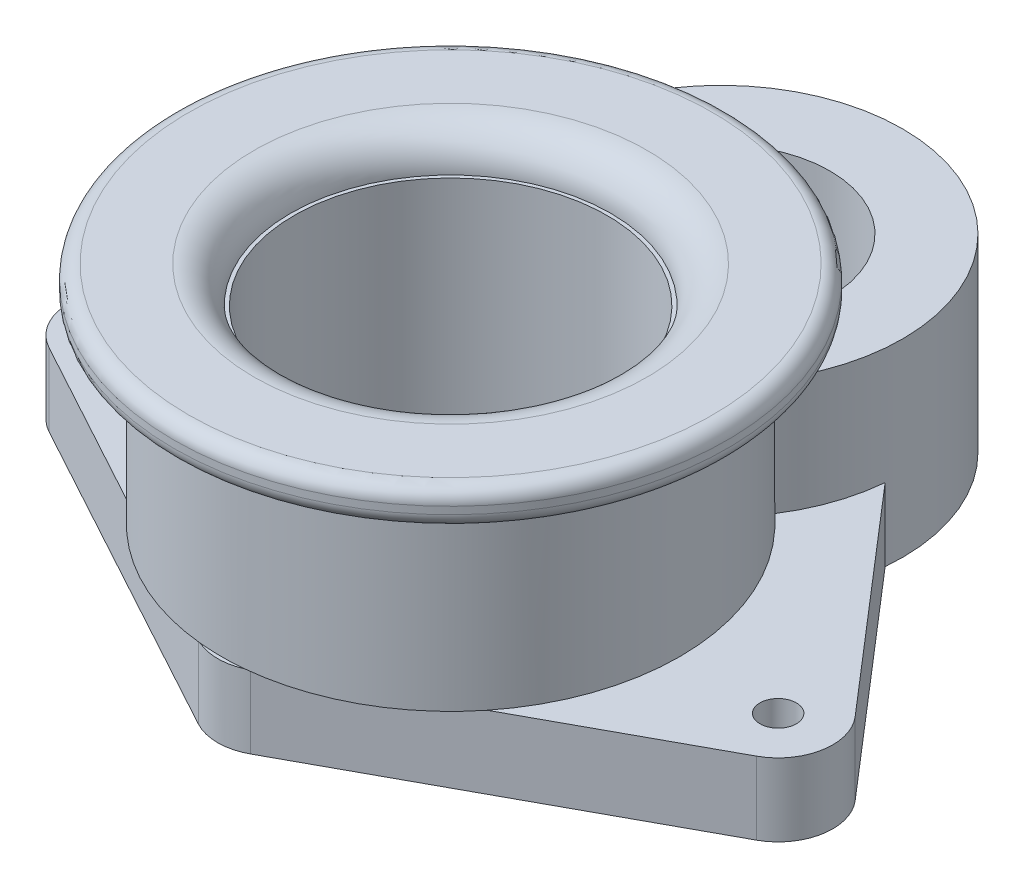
ISO-10303-21;
HEADER;
FILE_DESCRIPTION(('STEP AP214'),'2;1');
FILE_NAME('part.step','',(''),(''),'','','');
FILE_SCHEMA(('AUTOMOTIVE_DESIGN { 1 0 10303 214 1 1 1 1 }'));
ENDSEC;
DATA;
#1=APPLICATION_CONTEXT('core data for automotive mechanical design processes');
#2=APPLICATION_PROTOCOL_DEFINITION('international standard','automotive_design',2000,#1);
#3=PRODUCT_CONTEXT('',#1,'mechanical');
#4=PRODUCT('Part','Part','',(#3));
#5=PRODUCT_RELATED_PRODUCT_CATEGORY('part','',(#4));
#6=PRODUCT_DEFINITION_FORMATION('','',#4);
#7=PRODUCT_DEFINITION_CONTEXT('part definition',#1,'design');
#8=PRODUCT_DEFINITION('design','',#6,#7);
#9=PRODUCT_DEFINITION_SHAPE('','',#8);
#10=(LENGTH_UNIT() NAMED_UNIT(*) SI_UNIT(.MILLI.,.METRE.));
#11=(NAMED_UNIT(*) PLANE_ANGLE_UNIT() SI_UNIT($,.RADIAN.));
#12=(NAMED_UNIT(*) SI_UNIT($,.STERADIAN.) SOLID_ANGLE_UNIT());
#13=UNCERTAINTY_MEASURE_WITH_UNIT(LENGTH_MEASURE(1.E-05),#10,'distance_accuracy_value','');
#14=(GEOMETRIC_REPRESENTATION_CONTEXT(3) GLOBAL_UNCERTAINTY_ASSIGNED_CONTEXT((#13)) GLOBAL_UNIT_ASSIGNED_CONTEXT((#10,
#11,#12)) REPRESENTATION_CONTEXT('',''));
#15=CARTESIAN_POINT('',(0.,0.,0.));
#16=DIRECTION('',(0.,0.,1.));
#17=DIRECTION('',(1.,0.,0.));
#18=AXIS2_PLACEMENT_3D('',#15,#16,#17);
#19=CARTESIAN_POINT('',(0.,36.,0.));
#20=DIRECTION('',(0.,1.,0.));
#21=DIRECTION('',(0.,0.,1.));
#22=AXIS2_PLACEMENT_3D('',#19,#20,#21);
#23=PLANE('',#22);
#24=CARTESIAN_POINT('',(0.,36.,0.));
#25=DIRECTION('',(0.,1.,0.));
#26=DIRECTION('',(0.,0.,1.));
#27=AXIS2_PLACEMENT_3D('',#24,#25,#26);
#28=CIRCLE('',#27,21.5);
#29=CARTESIAN_POINT('',(0.,36.,21.5));
#30=VERTEX_POINT('',#29);
#31=EDGE_CURVE('E366',#30,#30,#28,.T.);
#32=ORIENTED_EDGE('',*,*,#31,.F.);
#33=EDGE_LOOP('',(#32));
#34=FACE_BOUND('',#33,.T.);
#35=CARTESIAN_POINT('',(0.,36.,0.));
#36=DIRECTION('',(0.,1.,0.));
#37=DIRECTION('',(0.,0.,1.));
#38=AXIS2_PLACEMENT_3D('',#35,#36,#37);
#39=CIRCLE('',#38,22.);
#40=CARTESIAN_POINT('',(0.,36.,22.));
#41=VERTEX_POINT('',#40);
#42=EDGE_CURVE('E416',#41,#41,#39,.T.);
#43=ORIENTED_EDGE('',*,*,#42,.T.);
#44=EDGE_LOOP('',(#43));
#45=FACE_BOUND('',#44,.T.);
#46=ADVANCED_FACE('F32',(#34,#45),#23,.T.);
#47=CARTESIAN_POINT('',(0.,10.,0.));
#48=DIRECTION('',(0.,1.,0.));
#49=DIRECTION('',(0.,0.,1.));
#50=AXIS2_PLACEMENT_3D('',#47,#48,#49);
#51=PLANE('',#50);
#52=CARTESIAN_POINT('',(0.,10.,0.));
#53=DIRECTION('',(0.,1.,0.));
#54=DIRECTION('',(0.,0.,1.));
#55=AXIS2_PLACEMENT_3D('',#52,#53,#54);
#56=CIRCLE('',#55,31.5);
#57=CARTESIAN_POINT('',(-3.04951416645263,10.,31.3520408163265));
#58=VERTEX_POINT('',#57);
#59=CARTESIAN_POINT('',(3.04951416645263,10.,31.3520408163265));
#60=VERTEX_POINT('',#59);
#61=EDGE_CURVE('E524',#58,#60,#56,.T.);
#62=ORIENTED_EDGE('',*,*,#61,.F.);
#63=CARTESIAN_POINT('',(0.,10.,24.5));
#64=DIRECTION('',(0.,-1.,0.));
#65=DIRECTION('',(0.,0.,-1.));
#66=AXIS2_PLACEMENT_3D('',#63,#64,#65);
#67=CIRCLE('',#66,7.5);
#68=EDGE_CURVE('E423',#60,#58,#67,.T.);
#69=ORIENTED_EDGE('',*,*,#68,.F.);
#70=EDGE_LOOP('',(#62,#69));
#71=FACE_BOUND('',#70,.T.);
#72=ADVANCED_FACE('F339',(#71),#51,.T.);
#73=CARTESIAN_POINT('',(45.,10.,0.));
#74=DIRECTION('',(0.,1.,0.));
#75=DIRECTION('',(0.,0.,1.));
#76=AXIS2_PLACEMENT_3D('',#73,#74,#75);
#77=CIRCLE('',#76,2.5);
#78=CARTESIAN_POINT('',(45.,10.,2.5));
#79=VERTEX_POINT('',#78);
#80=EDGE_CURVE('E215',#79,#79,#77,.T.);
#81=ORIENTED_EDGE('',*,*,#80,.F.);
#82=EDGE_LOOP('',(#81));
#83=FACE_BOUND('',#82,.T.);
#84=CARTESIAN_POINT('',(24.6400893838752,10.,19.6243724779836));
#85=VERTEX_POINT('',#84);
#86=CARTESIAN_POINT('',(20.9767808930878,10.,-23.499460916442));
#87=VERTEX_POINT('',#86);
#88=EDGE_CURVE('E197',#85,#87,#56,.T.);
#89=ORIENTED_EDGE('',*,*,#88,.F.);
#90=DIRECTION('',(-0.878268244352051,0.,0.47816826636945));
#91=VECTOR('',#90,1.);
#92=CARTESIAN_POINT('',(3.58626199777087,10.,31.0870118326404));
#93=LINE('',#92,#91);
#94=CARTESIAN_POINT('',(48.5862619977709,10.,6.58701183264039));
#95=VERTEX_POINT('',#94);
#96=EDGE_CURVE('E425',#95,#85,#93,.T.);
#97=ORIENTED_EDGE('',*,*,#96,.F.);
#98=CARTESIAN_POINT('',(45.,10.,0.));
#99=DIRECTION('',(0.,-1.,0.));
#100=DIRECTION('',(0.,0.,-1.));
#101=AXIS2_PLACEMENT_3D('',#98,#99,#100);
#102=CIRCLE('',#101,7.50000000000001);
#103=CARTESIAN_POINT('',(50.6800479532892,10.,-4.897658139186));
#104=VERTEX_POINT('',#103);
#105=EDGE_CURVE('E429',#104,#95,#102,.T.);
#106=ORIENTED_EDGE('',*,*,#105,.F.);
#107=DIRECTION('',(0.653021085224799,0.,0.757339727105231));
#108=VECTOR('',#107,1.);
#109=CARTESIAN_POINT('',(50.6800479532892,10.,-4.897658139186));
#110=LINE('',#109,#108);
#111=CARTESIAN_POINT('',(24.894225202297,10.,-34.8027077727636));
#112=VERTEX_POINT('',#111);
#113=EDGE_CURVE('E432',#112,#104,#110,.T.);
#114=ORIENTED_EDGE('',*,*,#113,.F.);
#115=CARTESIAN_POINT('',(0.,10.,-37.1));
#116=DIRECTION('',(0.,1.,0.));
#117=DIRECTION('',(0.,0.,1.));
#118=AXIS2_PLACEMENT_3D('',#115,#116,#117);
#119=CIRCLE('',#118,25.);
#120=EDGE_CURVE('E194',#87,#112,#119,.T.);
#121=ORIENTED_EDGE('',*,*,#120,.F.);
#122=EDGE_LOOP('',(#89,#97,#106,#114,#121));
#123=FACE_BOUND('',#122,.T.);
#124=ADVANCED_FACE('F345',(#83,#123),#51,.T.);
#125=CARTESIAN_POINT('',(-45.,10.,0.));
#126=DIRECTION('',(0.,1.,0.));
#127=DIRECTION('',(0.,0.,1.));
#128=AXIS2_PLACEMENT_3D('',#125,#126,#127);
#129=CIRCLE('',#128,2.5);
#130=CARTESIAN_POINT('',(-45.,10.,2.5));
#131=VERTEX_POINT('',#130);
#132=EDGE_CURVE('E220',#131,#131,#129,.T.);
#133=ORIENTED_EDGE('',*,*,#132,.F.);
#134=EDGE_LOOP('',(#133));
#135=FACE_BOUND('',#134,.T.);
#136=CARTESIAN_POINT('',(-45.,10.,0.));
#137=DIRECTION('',(0.,-1.,0.));
#138=DIRECTION('',(0.,0.,-1.));
#139=AXIS2_PLACEMENT_3D('',#136,#137,#138);
#140=CIRCLE('',#139,7.50000000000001);
#141=CARTESIAN_POINT('',(-48.5862619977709,10.,6.58701183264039));
#142=VERTEX_POINT('',#141);
#143=CARTESIAN_POINT('',(-50.6800479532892,10.,-4.897658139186));
#144=VERTEX_POINT('',#143);
#145=EDGE_CURVE('E394',#142,#144,#140,.T.);
#146=ORIENTED_EDGE('',*,*,#145,.F.);
#147=DIRECTION('',(-0.878268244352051,0.,-0.47816826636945));
#148=VECTOR('',#147,1.);
#149=CARTESIAN_POINT('',(-48.5862619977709,10.,6.58701183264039));
#150=LINE('',#149,#148);
#151=CARTESIAN_POINT('',(-24.6400893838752,10.,19.6243724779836));
#152=VERTEX_POINT('',#151);
#153=EDGE_CURVE('E419',#152,#142,#150,.T.);
#154=ORIENTED_EDGE('',*,*,#153,.F.);
#155=CARTESIAN_POINT('',(-20.9767808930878,10.,-23.4994609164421));
#156=VERTEX_POINT('',#155);
#157=EDGE_CURVE('E193',#156,#152,#56,.T.);
#158=ORIENTED_EDGE('',*,*,#157,.F.);
#159=CARTESIAN_POINT('',(-24.894225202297,10.,-34.8027077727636));
#160=VERTEX_POINT('',#159);
#161=EDGE_CURVE('E188',#160,#156,#119,.T.);
#162=ORIENTED_EDGE('',*,*,#161,.F.);
#163=DIRECTION('',(0.653021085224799,0.,-0.757339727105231));
#164=VECTOR('',#163,1.);
#165=CARTESIAN_POINT('',(-50.6800479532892,10.,-4.897658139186));
#166=LINE('',#165,#164);
#167=EDGE_CURVE('E435',#144,#160,#166,.T.);
#168=ORIENTED_EDGE('',*,*,#167,.F.);
#169=EDGE_LOOP('',(#146,#154,#158,#162,#168));
#170=FACE_BOUND('',#169,.T.);
#171=ADVANCED_FACE('F347',(#135,#170),#51,.T.);
#172=CARTESIAN_POINT('',(0.,0.,0.));
#173=DIRECTION('',(0.,1.,0.));
#174=DIRECTION('',(0.,0.,1.));
#175=AXIS2_PLACEMENT_3D('',#172,#173,#174);
#176=PLANE('',#175);
#177=CARTESIAN_POINT('',(45.,0.,0.));
#178=DIRECTION('',(0.,1.,0.));
#179=DIRECTION('',(0.,0.,1.));
#180=AXIS2_PLACEMENT_3D('',#177,#178,#179);
#181=CIRCLE('',#180,2.5);
#182=CARTESIAN_POINT('',(45.,0.,2.5));
#183=VERTEX_POINT('',#182);
#184=EDGE_CURVE('E223',#183,#183,#181,.T.);
#185=ORIENTED_EDGE('',*,*,#184,.T.);
#186=EDGE_LOOP('',(#185));
#187=FACE_BOUND('',#186,.T.);
#188=CARTESIAN_POINT('',(-45.,0.,0.));
#189=DIRECTION('',(0.,1.,0.));
#190=DIRECTION('',(0.,0.,1.));
#191=AXIS2_PLACEMENT_3D('',#188,#189,#190);
#192=CIRCLE('',#191,2.5);
#193=CARTESIAN_POINT('',(-45.,0.,2.5));
#194=VERTEX_POINT('',#193);
#195=EDGE_CURVE('E216',#194,#194,#192,.T.);
#196=ORIENTED_EDGE('',*,*,#195,.T.);
#197=EDGE_LOOP('',(#196));
#198=FACE_BOUND('',#197,.T.);
#199=CARTESIAN_POINT('',(23.3644389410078,0.,-7.37244823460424));
#200=DIRECTION('',(0.,1.,0.));
#201=DIRECTION('',(0.,0.,1.));
#202=AXIS2_PLACEMENT_3D('',#199,#200,#201);
#203=CIRCLE('',#202,2.5);
#204=CARTESIAN_POINT('',(21.8456857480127,0.,-5.38665148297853));
#205=VERTEX_POINT('',#204);
#206=CARTESIAN_POINT('',(20.9810097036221,0.,-8.12694480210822));
#207=VERTEX_POINT('',#206);
#208=EDGE_CURVE('E232',#205,#207,#203,.T.);
#209=ORIENTED_EDGE('',*,*,#208,.T.);
#210=CARTESIAN_POINT('',(0.,0.,0.));
#211=DIRECTION('',(0.,1.,0.));
#212=DIRECTION('',(0.,0.,1.));
#213=AXIS2_PLACEMENT_3D('',#210,#211,#212);
#214=CIRCLE('',#213,22.5);
#215=CARTESIAN_POINT('',(2.67490762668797,0.,-22.3404312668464));
#216=VERTEX_POINT('',#215);
#217=EDGE_CURVE('E257',#207,#216,#214,.T.);
#218=ORIENTED_EDGE('',*,*,#217,.T.);
#219=CARTESIAN_POINT('',(0.,0.,-37.1));
#220=DIRECTION('',(0.,1.,0.));
#221=DIRECTION('',(0.,0.,1.));
#222=AXIS2_PLACEMENT_3D('',#219,#220,#221);
#223=CIRCLE('',#222,15.);
#224=CARTESIAN_POINT('',(-2.67490762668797,0.,-22.3404312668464));
#225=VERTEX_POINT('',#224);
#226=EDGE_CURVE('E213',#216,#225,#223,.T.);
#227=ORIENTED_EDGE('',*,*,#226,.T.);
#228=CARTESIAN_POINT('',(0.,0.,0.));
#229=DIRECTION('',(0.,1.,0.));
#230=DIRECTION('',(0.,0.,1.));
#231=AXIS2_PLACEMENT_3D('',#228,#229,#230);
#232=CIRCLE('',#231,22.5);
#233=CARTESIAN_POINT('',(-20.9810097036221,0.,-8.12694480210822));
#234=VERTEX_POINT('',#233);
#235=EDGE_CURVE('E255',#225,#234,#232,.T.);
#236=ORIENTED_EDGE('',*,*,#235,.T.);
#237=CARTESIAN_POINT('',(-23.3644389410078,0.,-7.37244823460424));
#238=DIRECTION('',(0.,1.,0.));
#239=DIRECTION('',(0.,0.,1.));
#240=AXIS2_PLACEMENT_3D('',#237,#238,#239);
#241=CIRCLE('',#240,2.5);
#242=CARTESIAN_POINT('',(-21.8456857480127,0.,-5.38665148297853));
#243=VERTEX_POINT('',#242);
#244=EDGE_CURVE('E228',#234,#243,#241,.T.);
#245=ORIENTED_EDGE('',*,*,#244,.T.);
#246=CARTESIAN_POINT('',(0.,0.,0.));
#247=DIRECTION('',(0.,1.,0.));
#248=DIRECTION('',(0.,0.,1.));
#249=AXIS2_PLACEMENT_3D('',#246,#247,#248);
#250=CIRCLE('',#249,22.5);
#251=CARTESIAN_POINT('',(-1.43673867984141,0.,22.4540816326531));
#252=VERTEX_POINT('',#251);
#253=EDGE_CURVE('E253',#243,#252,#250,.T.);
#254=ORIENTED_EDGE('',*,*,#253,.T.);
#255=CARTESIAN_POINT('',(0.,0.,24.5));
#256=DIRECTION('',(0.,1.,0.));
#257=DIRECTION('',(0.,0.,1.));
#258=AXIS2_PLACEMENT_3D('',#255,#256,#257);
#259=CIRCLE('',#258,2.5);
#260=CARTESIAN_POINT('',(1.43673867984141,0.,22.4540816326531));
#261=VERTEX_POINT('',#260);
#262=EDGE_CURVE('E219',#252,#261,#259,.T.);
#263=ORIENTED_EDGE('',*,*,#262,.T.);
#264=CARTESIAN_POINT('',(0.,0.,0.));
#265=DIRECTION('',(0.,1.,0.));
#266=DIRECTION('',(0.,0.,1.));
#267=AXIS2_PLACEMENT_3D('',#264,#265,#266);
#268=CIRCLE('',#267,22.5);
#269=EDGE_CURVE('E251',#261,#205,#268,.T.);
#270=ORIENTED_EDGE('',*,*,#269,.T.);
#271=EDGE_LOOP('',(#209,#218,#227,#236,#245,#254,#263,#270));
#272=FACE_BOUND('',#271,.T.);
#273=CARTESIAN_POINT('',(-45.,0.,0.));
#274=DIRECTION('',(0.,-1.,0.));
#275=DIRECTION('',(0.,0.,-1.));
#276=AXIS2_PLACEMENT_3D('',#273,#274,#275);
#277=CIRCLE('',#276,7.50000000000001);
#278=CARTESIAN_POINT('',(-48.5862619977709,0.,6.58701183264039));
#279=VERTEX_POINT('',#278);
#280=CARTESIAN_POINT('',(-50.6800479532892,0.,-4.897658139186));
#281=VERTEX_POINT('',#280);
#282=EDGE_CURVE('E413',#279,#281,#277,.T.);
#283=ORIENTED_EDGE('',*,*,#282,.T.);
#284=DIRECTION('',(0.653021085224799,0.,-0.757339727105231));
#285=VECTOR('',#284,1.);
#286=CARTESIAN_POINT('',(-50.6800479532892,0.,-4.897658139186));
#287=LINE('',#286,#285);
#288=CARTESIAN_POINT('',(-24.894225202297,0.,-34.8027077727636));
#289=VERTEX_POINT('',#288);
#290=EDGE_CURVE('E410',#281,#289,#287,.T.);
#291=ORIENTED_EDGE('',*,*,#290,.T.);
#292=CARTESIAN_POINT('',(0.,0.,-37.1));
#293=DIRECTION('',(0.,-1.,0.));
#294=DIRECTION('',(0.,0.,-1.));
#295=AXIS2_PLACEMENT_3D('',#292,#293,#294);
#296=CIRCLE('',#295,25.);
#297=CARTESIAN_POINT('',(24.894225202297,0.,-34.8027077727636));
#298=VERTEX_POINT('',#297);
#299=EDGE_CURVE('E407',#289,#298,#296,.T.);
#300=ORIENTED_EDGE('',*,*,#299,.T.);
#301=DIRECTION('',(0.653021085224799,0.,0.757339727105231));
#302=VECTOR('',#301,1.);
#303=CARTESIAN_POINT('',(50.6800479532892,0.,-4.897658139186));
#304=LINE('',#303,#302);
#305=CARTESIAN_POINT('',(50.6800479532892,0.,-4.897658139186));
#306=VERTEX_POINT('',#305);
#307=EDGE_CURVE('E404',#298,#306,#304,.T.);
#308=ORIENTED_EDGE('',*,*,#307,.T.);
#309=CARTESIAN_POINT('',(45.,0.,0.));
#310=DIRECTION('',(0.,-1.,0.));
#311=DIRECTION('',(0.,0.,-1.));
#312=AXIS2_PLACEMENT_3D('',#309,#310,#311);
#313=CIRCLE('',#312,7.50000000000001);
#314=CARTESIAN_POINT('',(48.5862619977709,0.,6.58701183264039));
#315=VERTEX_POINT('',#314);
#316=EDGE_CURVE('E401',#306,#315,#313,.T.);
#317=ORIENTED_EDGE('',*,*,#316,.T.);
#318=DIRECTION('',(-0.878268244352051,0.,0.47816826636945));
#319=VECTOR('',#318,1.);
#320=CARTESIAN_POINT('',(3.58626199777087,0.,31.0870118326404));
#321=LINE('',#320,#319);
#322=CARTESIAN_POINT('',(3.58626199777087,0.,31.0870118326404));
#323=VERTEX_POINT('',#322);
#324=EDGE_CURVE('E398',#315,#323,#321,.T.);
#325=ORIENTED_EDGE('',*,*,#324,.T.);
#326=CARTESIAN_POINT('',(0.,0.,24.5));
#327=DIRECTION('',(0.,-1.,0.));
#328=DIRECTION('',(0.,0.,-1.));
#329=AXIS2_PLACEMENT_3D('',#326,#327,#328);
#330=CIRCLE('',#329,7.5);
#331=CARTESIAN_POINT('',(-3.58626199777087,0.,31.0870118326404));
#332=VERTEX_POINT('',#331);
#333=EDGE_CURVE('E395',#323,#332,#330,.T.);
#334=ORIENTED_EDGE('',*,*,#333,.T.);
#335=DIRECTION('',(-0.878268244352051,0.,-0.47816826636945));
#336=VECTOR('',#335,1.);
#337=CARTESIAN_POINT('',(-48.5862619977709,0.,6.58701183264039));
#338=LINE('',#337,#336);
#339=EDGE_CURVE('E391',#332,#279,#338,.T.);
#340=ORIENTED_EDGE('',*,*,#339,.T.);
#341=EDGE_LOOP('',(#283,#291,#300,#308,#317,#325,#334,#340));
#342=FACE_BOUND('',#341,.T.);
#343=ADVANCED_FACE('F316',(#187,#198,#272,#342),#176,.F.);
#344=CARTESIAN_POINT('',(0.,0.,24.5));
#345=DIRECTION('',(0.,1.,0.));
#346=DIRECTION('',(0.,0.,1.));
#347=AXIS2_PLACEMENT_3D('',#344,#345,#346);
#348=CYLINDRICAL_SURFACE('',#347,2.5);
#349=ORIENTED_EDGE('',*,*,#262,.F.);
#350=CARTESIAN_POINT('',(-1.43673867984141,0.,22.4540816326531));
#351=CARTESIAN_POINT('',(-1.38761921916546,1.71798852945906E-05,22.419579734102));
#352=CARTESIAN_POINT('',(-1.33730693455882,0.00211480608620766,22.3868970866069));
#353=CARTESIAN_POINT('',(-1.23470646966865,0.0093487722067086,22.3253590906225));
#354=CARTESIAN_POINT('',(-1.1824217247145,0.0144800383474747,22.2964974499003));
#355=CARTESIAN_POINT('',(-1.07586457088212,0.0266959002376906,22.2425449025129));
#356=CARTESIAN_POINT('',(-1.02158381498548,0.0337897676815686,22.2174727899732));
#357=CARTESIAN_POINT('',(-0.911453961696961,0.0489031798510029,22.1713055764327));
#358=CARTESIAN_POINT('',(-0.855604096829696,0.0569231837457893,22.1502124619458));
#359=CARTESIAN_POINT('',(-0.739379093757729,0.0733634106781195,22.1110071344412));
#360=CARTESIAN_POINT('',(-0.678925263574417,0.0817810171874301,22.0931266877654));
#361=CARTESIAN_POINT('',(-0.556704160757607,0.0974976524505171,22.0619563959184));
#362=CARTESIAN_POINT('',(-0.49493703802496,0.104796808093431,22.0486660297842));
#363=CARTESIAN_POINT('',(-0.370636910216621,0.117303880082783,22.0268256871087));
#364=CARTESIAN_POINT('',(-0.308108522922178,0.122520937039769,22.0182549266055));
#365=CARTESIAN_POINT('',(-0.182411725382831,0.130200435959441,22.0058642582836));
#366=CARTESIAN_POINT('',(-0.119243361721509,0.132663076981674,22.002044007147));
#367=CARTESIAN_POINT('',(0.00969564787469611,0.134515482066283,21.999155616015));
#368=CARTESIAN_POINT('',(0.0754725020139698,0.133782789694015,22.0002768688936));
#369=CARTESIAN_POINT('',(0.206615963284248,0.129076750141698,22.0076868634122));
#370=CARTESIAN_POINT('',(0.271982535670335,0.125103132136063,22.0139760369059));
#371=CARTESIAN_POINT('',(0.402129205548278,0.11448865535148,22.0316750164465));
#372=CARTESIAN_POINT('',(0.466904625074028,0.107834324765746,22.0431107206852));
#373=CARTESIAN_POINT('',(0.595168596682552,0.092812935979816,22.0709911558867));
#374=CARTESIAN_POINT('',(0.6586568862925,0.0844455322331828,22.0874368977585));
#375=CARTESIAN_POINT('',(0.785066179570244,0.0670090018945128,22.1255322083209));
#376=CARTESIAN_POINT('',(0.847962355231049,0.0579308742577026,22.1472599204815));
#377=CARTESIAN_POINT('',(0.971880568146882,0.040507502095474,22.1956839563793));
#378=CARTESIAN_POINT('',(1.03290356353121,0.0321618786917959,22.2223776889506));
#379=CARTESIAN_POINT('',(1.15249247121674,0.0176283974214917,22.2805071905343));
#380=CARTESIAN_POINT('',(1.21107081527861,0.0114280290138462,22.3119138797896));
#381=CARTESIAN_POINT('',(1.32583798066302,0.00262344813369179,22.3794791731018));
#382=CARTESIAN_POINT('',(1.38202200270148,2.61568474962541E-05,22.4156467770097));
#383=CARTESIAN_POINT('',(1.43673867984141,0.,22.4540816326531));
#384=B_SPLINE_CURVE_WITH_KNOTS('',3,(#350,#351,#352,#353,#354,#355,#356,#357,#358,#359,#360,
#361,#362,#363,#364,#365,#366,#367,#368,#369,#370,#371,#372,#373,#374,#375,#376,#377,#378,#379,
#380,#381,#382,#383),.UNSPECIFIED.,.F.,.F.,(4,2,2,2,2,2,2,2,2,2,2,2,2,2,2,2,4),(0.,
0.179905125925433,0.359510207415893,0.539978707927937,0.720537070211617,0.911162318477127,
1.10176592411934,1.29152330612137,1.48126697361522,1.67834487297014,1.87543924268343,
2.07353671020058,2.27167417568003,2.47294341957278,2.67410793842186,2.8740787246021,
3.07443310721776),.UNSPECIFIED.);
#385=EDGE_CURVE('E303',#252,#261,#384,.T.);
#386=ORIENTED_EDGE('',*,*,#385,.T.);
#387=EDGE_LOOP('',(#349,#386));
#388=FACE_BOUND('',#387,.T.);
#389=CARTESIAN_POINT('',(0.,10.,24.5));
#390=DIRECTION('',(0.,1.,0.));
#391=DIRECTION('',(0.,0.,1.));
#392=AXIS2_PLACEMENT_3D('',#389,#390,#391);
#393=CIRCLE('',#392,2.5);
#394=CARTESIAN_POINT('',(0.,10.,27.));
#395=VERTEX_POINT('',#394);
#396=EDGE_CURVE('E210',#395,#395,#393,.F.);
#397=ORIENTED_EDGE('',*,*,#396,.F.);
#398=EDGE_LOOP('',(#397));
#399=FACE_BOUND('',#398,.T.);
#400=ADVANCED_FACE('F295',(#388,#399),#348,.F.);
#401=CARTESIAN_POINT('',(23.3644389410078,0.,-7.37244823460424));
#402=DIRECTION('',(0.,1.,0.));
#403=DIRECTION('',(0.,0.,1.));
#404=AXIS2_PLACEMENT_3D('',#401,#402,#403);
#405=CYLINDRICAL_SURFACE('',#404,2.5);
#406=ORIENTED_EDGE('',*,*,#208,.F.);
#407=CARTESIAN_POINT('',(21.8456857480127,0.,-5.38665148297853));
#408=CARTESIAN_POINT('',(21.7980021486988,1.71798852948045E-05,-5.42311210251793));
#409=CARTESIAN_POINT('',(21.7516945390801,0.0021148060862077,-5.46125770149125));
#410=CARTESIAN_POINT('',(21.6621346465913,0.00934877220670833,-5.54058490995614));
#411=CARTESIAN_POINT('',(21.6188773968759,0.0144800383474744,-5.58176134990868));
#412=CARTESIAN_POINT('',(21.5353607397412,0.0266959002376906,-5.66714444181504));
#413=CARTESIAN_POINT('',(21.4951167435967,0.0337897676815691,-5.71136470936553));
#414=CARTESIAN_POINT('',(21.4179494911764,0.0489031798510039,-5.80249764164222));
#415=CARTESIAN_POINT('',(21.3810278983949,0.0569231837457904,-5.84941163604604));
#416=CARTESIAN_POINT('',(21.3086657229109,0.0733634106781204,-5.94845215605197));
#417=CARTESIAN_POINT('',(21.2734224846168,0.0817810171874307,-6.00072346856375));
#418=CARTESIAN_POINT('',(21.2069186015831,0.0974976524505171,-6.1079000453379));
#419=CARTESIAN_POINT('',(21.1756575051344,0.104796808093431,-6.16280500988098));
#420=CARTESIAN_POINT('',(21.1174255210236,0.117303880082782,-6.27477178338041));
#421=CARTESIAN_POINT('',(21.0904362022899,0.122520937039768,-6.3318229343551));
#422=CARTESIAN_POINT('',(21.0407956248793,0.13020043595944,-6.44796520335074));
#423=CARTESIAN_POINT('',(21.0181440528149,0.132663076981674,-6.50705617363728));
#424=CARTESIAN_POINT('',(20.9765896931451,0.134515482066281,-6.62914976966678));
#425=CARTESIAN_POINT('',(20.9578656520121,0.133782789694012,-6.69221530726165));
#426=CARTESIAN_POINT('',(20.925468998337,0.129076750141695,-6.81951013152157));
#427=CARTESIAN_POINT('',(20.9117968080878,0.125103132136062,-6.88373951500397));
#428=CARTESIAN_POINT('',(20.8895122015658,0.114488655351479,-7.01317987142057));
#429=CARTESIAN_POINT('',(20.8809258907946,0.107834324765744,-7.07839417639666));
#430=CARTESIAN_POINT('',(20.8689173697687,0.0928129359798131,-7.20910286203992));
#431=CARTESIAN_POINT('',(20.8654962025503,0.0844455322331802,-7.27459729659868));
#432=CARTESIAN_POINT('',(20.8637872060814,0.0670090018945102,-7.40661108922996));
#433=CARTESIAN_POINT('',(20.8655813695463,0.0579308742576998,-7.47313028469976));
#434=CARTESIAN_POINT('',(20.8744719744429,0.0405075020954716,-7.60587653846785));
#435=CARTESIAN_POINT('',(20.8815656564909,0.0321618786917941,-7.67210373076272));
#436=CARTESIAN_POINT('',(20.9010146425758,0.0176283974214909,-7.80364187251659));
#437=CARTESIAN_POINT('',(20.9133384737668,0.0114280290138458,-7.86895592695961));
#438=CARTESIAN_POINT('',(20.943236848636,0.00262344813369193,-7.99873519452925));
#439=CARTESIAN_POINT('',(20.9608214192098,2.61568474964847E-05,-8.06319853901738));
#440=CARTESIAN_POINT('',(20.9810097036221,0.,-8.12694480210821));
#441=B_SPLINE_CURVE_WITH_KNOTS('',3,(#407,#408,#409,#410,#411,#412,#413,#414,#415,#416,#417,
#418,#419,#420,#421,#422,#423,#424,#425,#426,#427,#428,#429,#430,#431,#432,#433,#434,#435,#436,
#437,#438,#439,#440),.UNSPECIFIED.,.F.,.F.,(4,2,2,2,2,2,2,2,2,2,2,2,2,2,2,2,4),(0.,
0.179905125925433,0.359510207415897,0.539978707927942,0.720537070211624,0.911162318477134,
1.10176592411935,1.29152330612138,1.48126697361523,1.67834487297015,1.87543924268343,
2.07353671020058,2.27167417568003,2.47294341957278,2.67410793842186,2.8740787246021,
3.07443310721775),.UNSPECIFIED.);
#442=EDGE_CURVE('E41',#205,#207,#441,.T.);
#443=ORIENTED_EDGE('',*,*,#442,.T.);
#444=EDGE_LOOP('',(#406,#443));
#445=FACE_BOUND('',#444,.T.);
#446=CARTESIAN_POINT('',(23.3644389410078,10.,-7.37244823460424));
#447=DIRECTION('',(0.,1.,0.));
#448=DIRECTION('',(0.,0.,1.));
#449=AXIS2_PLACEMENT_3D('',#446,#447,#448);
#450=CIRCLE('',#449,2.5);
#451=CARTESIAN_POINT('',(23.3644389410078,10.,-4.87244823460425));
#452=VERTEX_POINT('',#451);
#453=EDGE_CURVE('E207',#452,#452,#450,.F.);
#454=ORIENTED_EDGE('',*,*,#453,.F.);
#455=EDGE_LOOP('',(#454));
#456=FACE_BOUND('',#455,.T.);
#457=ADVANCED_FACE('F290',(#445,#456),#405,.F.);
#458=CARTESIAN_POINT('',(-23.3644389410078,0.,-7.37244823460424));
#459=DIRECTION('',(0.,1.,0.));
#460=DIRECTION('',(0.,0.,1.));
#461=AXIS2_PLACEMENT_3D('',#458,#459,#460);
#462=CYLINDRICAL_SURFACE('',#461,2.5);
#463=ORIENTED_EDGE('',*,*,#244,.F.);
#464=CARTESIAN_POINT('',(-20.9810097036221,0.,-8.12694480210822));
#465=CARTESIAN_POINT('',(-20.962887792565,1.71798852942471E-05,-8.0697198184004));
#466=CARTESIAN_POINT('',(-20.946859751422,0.00211480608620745,-8.01190473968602));
#467=CARTESIAN_POINT('',(-20.9190481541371,0.00934877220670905,-7.89554196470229));
#468=CARTESIAN_POINT('',(-20.9072575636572,0.0144800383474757,-7.83699565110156));
#469=CARTESIAN_POINT('',(-20.8878704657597,0.0266959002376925,-7.71914216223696));
#470=CARTESIAN_POINT('',(-20.8802943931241,0.0337897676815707,-7.65983268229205));
#471=CARTESIAN_POINT('',(-20.8694068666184,0.0489031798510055,-7.5409148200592));
#472=CARTESIAN_POINT('',(-20.8660975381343,0.0569231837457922,-7.48130630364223));
#473=CARTESIAN_POINT('',(-20.8636833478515,0.0733634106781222,-7.35867074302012));
#474=CARTESIAN_POINT('',(-20.8648231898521,0.0817810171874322,-7.2956383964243));
#475=CARTESIAN_POINT('',(-20.8718759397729,0.0974976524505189,-7.16970252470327));
#476=CARTESIAN_POINT('',(-20.8777883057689,0.104796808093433,-7.10679898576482));
#477=CARTESIAN_POINT('',(-20.8943641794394,0.117303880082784,-6.9816879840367));
#478=CARTESIAN_POINT('',(-20.9050064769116,0.122520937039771,-6.91947867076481));
#479=CARTESIAN_POINT('',(-20.9310143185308,0.130200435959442,-6.79587929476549));
#480=CARTESIAN_POINT('',(-20.9463795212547,0.132663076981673,-6.73448917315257));
#481=CARTESIAN_POINT('',(-20.9824248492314,0.134515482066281,-6.61065724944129));
#482=CARTESIAN_POINT('',(-21.0032874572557,0.133782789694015,-6.54826651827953));
#483=CARTESIAN_POINT('',(-21.0498172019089,0.129076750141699,-6.42543126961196));
#484=CARTESIAN_POINT('',(-21.0754847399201,0.125103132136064,-6.3649869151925));
#485=CARTESIAN_POINT('',(-21.1315266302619,0.114488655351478,-6.24619838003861));
#486=CARTESIAN_POINT('',(-21.161924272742,0.107834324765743,-6.18786645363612));
#487=CARTESIAN_POINT('',(-21.2271091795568,0.0928129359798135,-6.07393712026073));
#488=CARTESIAN_POINT('',(-21.2618973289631,0.0844455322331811,-6.01834026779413));
#489=CARTESIAN_POINT('',(-21.3362655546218,0.0670090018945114,-5.90925347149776));
#490=CARTESIAN_POINT('',(-21.3759126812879,0.0579308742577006,-5.85581071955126));
#491=CARTESIAN_POINT('',(-21.4593812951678,0.0405075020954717,-5.75220762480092));
#492=CARTESIAN_POINT('',(-21.5032005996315,0.032161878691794,-5.70204558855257));
#493=CARTESIAN_POINT('',(-21.594622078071,0.0176283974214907,-5.60549167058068));
#494=CARTESIAN_POINT('',(-21.6422002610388,0.0114280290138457,-5.55907918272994));
#495=CARTESIAN_POINT('',(-21.741169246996,0.00262344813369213,-5.46996290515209));
#496=CARTESIAN_POINT('',(-21.792567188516,2.61568474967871E-05,-5.42726640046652));
#497=CARTESIAN_POINT('',(-21.8456857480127,0.,-5.38665148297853));
#498=B_SPLINE_CURVE_WITH_KNOTS('',3,(#464,#465,#466,#467,#468,#469,#470,#471,#472,#473,#474,
#475,#476,#477,#478,#479,#480,#481,#482,#483,#484,#485,#486,#487,#488,#489,#490,#491,#492,#493,
#494,#495,#496,#497),.UNSPECIFIED.,.F.,.F.,(4,2,2,2,2,2,2,2,2,2,2,2,2,2,2,2,4),(0.,
0.179905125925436,0.359510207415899,0.539978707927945,0.720537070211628,0.911162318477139,
1.10176592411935,1.29152330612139,1.48126697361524,1.67834487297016,1.87543924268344,
2.07353671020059,2.27167417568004,2.47294341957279,2.67410793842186,2.8740787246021,
3.07443310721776),.UNSPECIFIED.);
#499=EDGE_CURVE('E265',#234,#243,#498,.T.);
#500=ORIENTED_EDGE('',*,*,#499,.T.);
#501=EDGE_LOOP('',(#463,#500));
#502=FACE_BOUND('',#501,.T.);
#503=CARTESIAN_POINT('',(-23.3644389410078,10.,-7.37244823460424));
#504=DIRECTION('',(0.,1.,0.));
#505=DIRECTION('',(0.,0.,1.));
#506=AXIS2_PLACEMENT_3D('',#503,#504,#505);
#507=CIRCLE('',#506,2.5);
#508=CARTESIAN_POINT('',(-23.3644389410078,10.,-4.87244823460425));
#509=VERTEX_POINT('',#508);
#510=EDGE_CURVE('E204',#509,#509,#507,.F.);
#511=ORIENTED_EDGE('',*,*,#510,.F.);
#512=EDGE_LOOP('',(#511));
#513=FACE_BOUND('',#512,.T.);
#514=ADVANCED_FACE('F285',(#502,#513),#462,.F.);
#515=CARTESIAN_POINT('',(45.,0.,0.));
#516=DIRECTION('',(0.,1.,0.));
#517=DIRECTION('',(0.,0.,1.));
#518=AXIS2_PLACEMENT_3D('',#515,#516,#517);
#519=CYLINDRICAL_SURFACE('',#518,2.5);
#520=ORIENTED_EDGE('',*,*,#184,.F.);
#521=EDGE_LOOP('',(#520));
#522=FACE_BOUND('',#521,.T.);
#523=ORIENTED_EDGE('',*,*,#80,.T.);
#524=EDGE_LOOP('',(#523));
#525=FACE_BOUND('',#524,.T.);
#526=ADVANCED_FACE('F282',(#522,#525),#519,.F.);
#527=CARTESIAN_POINT('',(-45.,0.,0.));
#528=DIRECTION('',(0.,1.,0.));
#529=DIRECTION('',(0.,0.,1.));
#530=AXIS2_PLACEMENT_3D('',#527,#528,#529);
#531=CYLINDRICAL_SURFACE('',#530,2.5);
#532=ORIENTED_EDGE('',*,*,#195,.F.);
#533=EDGE_LOOP('',(#532));
#534=FACE_BOUND('',#533,.T.);
#535=ORIENTED_EDGE('',*,*,#132,.T.);
#536=EDGE_LOOP('',(#535));
#537=FACE_BOUND('',#536,.T.);
#538=ADVANCED_FACE('F278',(#534,#537),#531,.F.);
#539=CARTESIAN_POINT('',(0.,0.,-37.1));
#540=DIRECTION('',(0.,1.,0.));
#541=DIRECTION('',(0.,0.,1.));
#542=AXIS2_PLACEMENT_3D('',#539,#540,#541);
#543=CYLINDRICAL_SURFACE('',#542,15.);
#544=ORIENTED_EDGE('',*,*,#226,.F.);
#545=CARTESIAN_POINT('',(2.67490762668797,0.,-22.3404312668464));
#546=CARTESIAN_POINT('',(2.59228774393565,6.87026879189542E-06,-22.3254577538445));
#547=CARTESIAN_POINT('',(2.50955219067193,0.000913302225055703,-22.3111800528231));
#548=CARTESIAN_POINT('',(2.34388745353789,0.00409632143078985,-22.2840209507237));
#549=CARTESIAN_POINT('',(2.26095829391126,0.00637274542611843,-22.2711393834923));
#550=CARTESIAN_POINT('',(2.01196799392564,0.0146121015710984,-22.234599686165));
#551=CARTESIAN_POINT('',(1.84564367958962,0.0219857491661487,-22.2130356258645));
#552=CARTESIAN_POINT('',(1.59629617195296,0.033682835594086,-22.1849481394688));
#553=CARTESIAN_POINT('',(1.51348448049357,0.0376733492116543,-22.1763175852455));
#554=CARTESIAN_POINT('',(1.34772537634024,0.0455752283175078,-22.1604361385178));
#555=CARTESIAN_POINT('',(1.26477796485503,0.0494865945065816,-22.1531852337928));
#556=CARTESIAN_POINT('',(1.01576979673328,0.0606713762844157,-22.1335061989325));
#557=CARTESIAN_POINT('',(0.849513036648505,0.0673970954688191,-22.1231483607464));
#558=CARTESIAN_POINT('',(0.543519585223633,0.0768300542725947,-22.1091993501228));
#559=CARTESIAN_POINT('',(0.403834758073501,0.0800107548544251,-22.104785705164));
#560=CARTESIAN_POINT('',(0.124355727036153,0.083572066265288,-22.0998644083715));
#561=CARTESIAN_POINT('',(-0.0154384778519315,0.0839526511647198,-22.0993567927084));
#562=CARTESIAN_POINT('',(-0.295055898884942,0.0818422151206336,-22.1022500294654));
#563=CARTESIAN_POINT('',(-0.43487907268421,0.0793492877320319,-22.1056534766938));
#564=CARTESIAN_POINT('',(-0.714312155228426,0.0719344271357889,-22.116365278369));
#565=CARTESIAN_POINT('',(-0.853922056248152,0.0670124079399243,-22.1236737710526));
#566=CARTESIAN_POINT('',(-1.13437898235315,0.0555642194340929,-22.1422877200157));
#567=CARTESIAN_POINT('',(-1.27522234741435,0.0490206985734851,-22.1536370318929));
#568=CARTESIAN_POINT('',(-1.55650832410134,0.0356321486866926,-22.1803069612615));
#569=CARTESIAN_POINT('',(-1.69695095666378,0.0287871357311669,-22.1956273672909));
#570=CARTESIAN_POINT('',(-1.97727072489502,0.0163428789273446,-22.2302211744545));
#571=CARTESIAN_POINT('',(-2.11714828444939,0.0107424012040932,-22.2494906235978));
#572=CARTESIAN_POINT('',(-2.32659651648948,0.00461663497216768,-22.2813651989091));
#573=CARTESIAN_POINT('',(-2.39636038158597,0.0029538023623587,-22.2924867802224));
#574=CARTESIAN_POINT('',(-2.53574668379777,0.000647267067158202,-22.3157184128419));
#575=CARTESIAN_POINT('',(-2.60536910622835,3.66528924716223E-06,-22.3278285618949));
#576=CARTESIAN_POINT('',(-2.67490762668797,0.,-22.3404312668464));
#577=B_SPLINE_CURVE_WITH_KNOTS('',3,(#545,#546,#547,#548,#549,#550,#551,#552,#553,#554,#555,
#556,#557,#558,#559,#560,#561,#562,#563,#564,#565,#566,#567,#568,#569,#570,#571,#572,#573,#574,
#575,#576),.UNSPECIFIED.,.F.,.F.,(4,2,2,2,2,2,2,2,2,2,2,2,2,2,2,4),(0.,0.251873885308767,
0.503717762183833,1.00722164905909,1.25728093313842,1.5073380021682,2.00736127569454,
2.42665830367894,2.84595921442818,3.26553847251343,3.6851325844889,4.10942684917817,
4.53369852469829,4.95754766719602,5.16952793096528,5.38152918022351),.UNSPECIFIED.);
#578=EDGE_CURVE('E47',#216,#225,#577,.T.);
#579=ORIENTED_EDGE('',*,*,#578,.T.);
#580=EDGE_LOOP('',(#544,#579));
#581=FACE_BOUND('',#580,.T.);
#582=CARTESIAN_POINT('',(0.,26.,-37.1));
#583=DIRECTION('',(0.,1.,0.));
#584=DIRECTION('',(0.,0.,1.));
#585=AXIS2_PLACEMENT_3D('',#582,#583,#584);
#586=CIRCLE('',#585,15.);
#587=CARTESIAN_POINT('',(6.32655804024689,26.,-23.499460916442));
#588=VERTEX_POINT('',#587);
#589=CARTESIAN_POINT('',(-6.3265580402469,26.,-23.4994609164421));
#590=VERTEX_POINT('',#589);
#591=EDGE_CURVE('E362',#588,#590,#586,.T.);
#592=ORIENTED_EDGE('',*,*,#591,.T.);
#593=EDGE_CURVE('E367',#590,#588,#586,.T.);
#594=ORIENTED_EDGE('',*,*,#593,.T.);
#595=EDGE_LOOP('',(#592,#594));
#596=FACE_BOUND('',#595,.T.);
#597=ADVANCED_FACE('F272',(#581,#596),#543,.F.);
#598=CARTESIAN_POINT('',(0.,0.,0.));
#599=DIRECTION('',(0.,1.,0.));
#600=DIRECTION('',(0.,0.,1.));
#601=AXIS2_PLACEMENT_3D('',#598,#599,#600);
#602=CYLINDRICAL_SURFACE('',#601,21.5);
#603=CARTESIAN_POINT('',(0.,1.,0.));
#604=DIRECTION('',(0.,1.,0.));
#605=DIRECTION('',(0.,0.,1.));
#606=AXIS2_PLACEMENT_3D('',#603,#604,#605);
#607=CIRCLE('',#606,21.5);
#608=CARTESIAN_POINT('',(0.,1.,21.5));
#609=VERTEX_POINT('',#608);
#610=EDGE_CURVE('E11',#609,#609,#607,.F.);
#611=ORIENTED_EDGE('',*,*,#610,.T.);
#612=EDGE_LOOP('',(#611));
#613=FACE_BOUND('',#612,.T.);
#614=ORIENTED_EDGE('',*,*,#31,.T.);
#615=EDGE_LOOP('',(#614));
#616=FACE_BOUND('',#615,.T.);
#617=ADVANCED_FACE('F277',(#613,#616),#602,.F.);
#618=CARTESIAN_POINT('',(0.,10.,-18.55));
#619=DIRECTION('',(0.,1.,0.));
#620=DIRECTION('',(0.,0.,1.));
#621=AXIS2_PLACEMENT_3D('',#618,#619,#620);
#622=PLANE('',#621);
#623=ORIENTED_EDGE('',*,*,#510,.T.);
#624=EDGE_LOOP('',(#623));
#625=FACE_BOUND('',#624,.T.);
#626=ADVANCED_FACE('F327',(#625),#622,.F.);
#627=ORIENTED_EDGE('',*,*,#453,.T.);
#628=EDGE_LOOP('',(#627));
#629=FACE_BOUND('',#628,.T.);
#630=ADVANCED_FACE('F324',(#629),#622,.F.);
#631=ORIENTED_EDGE('',*,*,#396,.T.);
#632=EDGE_LOOP('',(#631));
#633=FACE_BOUND('',#632,.T.);
#634=ADVANCED_FACE('F326',(#633),#622,.F.);
#635=CARTESIAN_POINT('',(0.,26.,-37.1));
#636=DIRECTION('',(0.,-1.,0.));
#637=DIRECTION('',(0.,0.,-1.));
#638=AXIS2_PLACEMENT_3D('',#635,#636,#637);
#639=CYLINDRICAL_SURFACE('',#638,25.);
#640=ORIENTED_EDGE('',*,*,#120,.T.);
#641=DIRECTION('',(0.,-1.,0.));
#642=VECTOR('',#641,1.);
#643=CARTESIAN_POINT('',(24.894225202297,10.,-34.8027077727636));
#644=LINE('',#643,#642);
#645=EDGE_CURVE('E379',#112,#298,#644,.T.);
#646=ORIENTED_EDGE('',*,*,#645,.T.);
#647=ORIENTED_EDGE('',*,*,#299,.F.);
#648=DIRECTION('',(0.,-1.,0.));
#649=VECTOR('',#648,1.);
#650=CARTESIAN_POINT('',(-24.894225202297,10.,-34.8027077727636));
#651=LINE('',#650,#649);
#652=EDGE_CURVE('E375',#160,#289,#651,.T.);
#653=ORIENTED_EDGE('',*,*,#652,.F.);
#654=ORIENTED_EDGE('',*,*,#161,.T.);
#655=DIRECTION('',(0.,-1.,0.));
#656=VECTOR('',#655,1.);
#657=CARTESIAN_POINT('',(-20.9767808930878,26.,-23.4994609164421));
#658=LINE('',#657,#656);
#659=CARTESIAN_POINT('',(-20.9767808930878,26.,-23.4994609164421));
#660=VERTEX_POINT('',#659);
#661=EDGE_CURVE('E202',#660,#156,#658,.T.);
#662=ORIENTED_EDGE('',*,*,#661,.F.);
#663=CARTESIAN_POINT('',(0.,26.,-37.1));
#664=DIRECTION('',(0.,1.,0.));
#665=DIRECTION('',(0.,0.,1.));
#666=AXIS2_PLACEMENT_3D('',#663,#664,#665);
#667=CIRCLE('',#666,25.);
#668=CARTESIAN_POINT('',(20.9767808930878,26.,-23.499460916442));
#669=VERTEX_POINT('',#668);
#670=EDGE_CURVE('E189',#669,#660,#667,.T.);
#671=ORIENTED_EDGE('',*,*,#670,.F.);
#672=DIRECTION('',(0.,-1.,0.));
#673=VECTOR('',#672,1.);
#674=CARTESIAN_POINT('',(20.9767808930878,26.,-23.499460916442));
#675=LINE('',#674,#673);
#676=EDGE_CURVE('E192',#669,#87,#675,.T.);
#677=ORIENTED_EDGE('',*,*,#676,.T.);
#678=EDGE_LOOP('',(#640,#646,#647,#653,#654,#662,#671,#677));
#679=FACE_BOUND('',#678,.T.);
#680=ADVANCED_FACE('F333',(#679),#639,.T.);
#681=CARTESIAN_POINT('',(0.,26.,0.));
#682=DIRECTION('',(0.,-1.,0.));
#683=DIRECTION('',(0.,0.,-1.));
#684=AXIS2_PLACEMENT_3D('',#681,#682,#683);
#685=CYLINDRICAL_SURFACE('',#684,31.5);
#686=ORIENTED_EDGE('',*,*,#157,.T.);
#687=EDGE_CURVE('E199',#152,#58,#56,.T.);
#688=ORIENTED_EDGE('',*,*,#687,.T.);
#689=ORIENTED_EDGE('',*,*,#61,.T.);
#690=EDGE_CURVE('E522',#60,#85,#56,.T.);
#691=ORIENTED_EDGE('',*,*,#690,.T.);
#692=ORIENTED_EDGE('',*,*,#88,.T.);
#693=ORIENTED_EDGE('',*,*,#676,.F.);
#694=DIRECTION('',(0.,-1.,0.));
#695=VECTOR('',#694,1.);
#696=CARTESIAN_POINT('',(20.9767808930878,36.,-23.499460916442));
#697=LINE('',#696,#695);
#698=CARTESIAN_POINT('',(20.9767808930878,36.,-23.499460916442));
#699=VERTEX_POINT('',#698);
#700=EDGE_CURVE('E167',#699,#669,#697,.T.);
#701=ORIENTED_EDGE('',*,*,#700,.F.);
#702=CARTESIAN_POINT('',(0.,36.,0.));
#703=DIRECTION('',(0.,1.,0.));
#704=DIRECTION('',(0.,0.,1.));
#705=AXIS2_PLACEMENT_3D('',#702,#703,#704);
#706=CIRCLE('',#705,31.5);
#707=CARTESIAN_POINT('',(-20.9767808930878,36.,-23.4994609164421));
#708=VERTEX_POINT('',#707);
#709=EDGE_CURVE('E159',#708,#699,#706,.T.);
#710=ORIENTED_EDGE('',*,*,#709,.F.);
#711=DIRECTION('',(0.,-1.,0.));
#712=VECTOR('',#711,1.);
#713=CARTESIAN_POINT('',(-20.9767808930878,36.,-23.4994609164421));
#714=LINE('',#713,#712);
#715=EDGE_CURVE('E164',#708,#660,#714,.T.);
#716=ORIENTED_EDGE('',*,*,#715,.T.);
#717=ORIENTED_EDGE('',*,*,#661,.T.);
#718=EDGE_LOOP('',(#686,#688,#689,#691,#692,#693,#701,#710,#716,#717));
#719=FACE_BOUND('',#718,.T.);
#720=ADVANCED_FACE('F162',(#719),#685,.T.);
#721=CARTESIAN_POINT('',(0.,26.,-18.55));
#722=DIRECTION('',(0.,1.,0.));
#723=DIRECTION('',(0.,0.,1.));
#724=AXIS2_PLACEMENT_3D('',#721,#722,#723);
#725=PLANE('',#724);
#726=ORIENTED_EDGE('',*,*,#591,.F.);
#727=DIRECTION('',(-1.,0.,0.));
#728=VECTOR('',#727,1.);
#729=CARTESIAN_POINT('',(-20.9767808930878,26.,-23.4994609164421));
#730=LINE('',#729,#728);
#731=EDGE_CURVE('E171',#669,#588,#730,.T.);
#732=ORIENTED_EDGE('',*,*,#731,.F.);
#733=ORIENTED_EDGE('',*,*,#670,.T.);
#734=EDGE_CURVE('E178',#590,#660,#730,.T.);
#735=ORIENTED_EDGE('',*,*,#734,.F.);
#736=EDGE_LOOP('',(#726,#732,#733,#735));
#737=FACE_BOUND('',#736,.T.);
#738=ADVANCED_FACE('F355',(#737),#725,.T.);
#739=CARTESIAN_POINT('',(-20.9767808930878,36.,-23.4994609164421));
#740=DIRECTION('',(0.,0.,1.));
#741=DIRECTION('',(1.,0.,0.));
#742=AXIS2_PLACEMENT_3D('',#739,#740,#741);
#743=PLANE('',#742);
#744=ORIENTED_EDGE('',*,*,#731,.T.);
#745=EDGE_CURVE('E185',#588,#590,#730,.T.);
#746=ORIENTED_EDGE('',*,*,#745,.T.);
#747=ORIENTED_EDGE('',*,*,#734,.T.);
#748=ORIENTED_EDGE('',*,*,#715,.F.);
#749=DIRECTION('',(-1.,0.,0.));
#750=VECTOR('',#749,1.);
#751=CARTESIAN_POINT('',(-20.9767808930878,36.,-23.4994609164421));
#752=LINE('',#751,#750);
#753=EDGE_CURVE('E170',#699,#708,#752,.T.);
#754=ORIENTED_EDGE('',*,*,#753,.F.);
#755=ORIENTED_EDGE('',*,*,#700,.T.);
#756=EDGE_LOOP('',(#744,#746,#747,#748,#754,#755));
#757=FACE_BOUND('',#756,.T.);
#758=ADVANCED_FACE('F175',(#757),#743,.F.);
#759=CARTESIAN_POINT('',(0.,26.,-37.1));
#760=DIRECTION('',(0.,1.,0.));
#761=DIRECTION('',(0.,0.,1.));
#762=AXIS2_PLACEMENT_3D('',#759,#760,#761);
#763=PLANE('',#762);
#764=ORIENTED_EDGE('',*,*,#593,.F.);
#765=ORIENTED_EDGE('',*,*,#745,.F.);
#766=EDGE_LOOP('',(#764,#765));
#767=FACE_BOUND('',#766,.T.);
#768=ADVANCED_FACE('F352',(#767),#763,.F.);
#769=CARTESIAN_POINT('',(0.,10.,0.));
#770=DIRECTION('',(0.,-1.,0.));
#771=DIRECTION('',(0.,0.,-1.));
#772=AXIS2_PLACEMENT_3D('',#769,#770,#771);
#773=PLANE('',#772);
#774=ORIENTED_EDGE('',*,*,#690,.F.);
#775=CARTESIAN_POINT('',(3.58626199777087,10.,31.0870118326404));
#776=VERTEX_POINT('',#775);
#777=EDGE_CURVE('E420',#776,#60,#67,.T.);
#778=ORIENTED_EDGE('',*,*,#777,.F.);
#779=EDGE_CURVE('E428',#85,#776,#93,.T.);
#780=ORIENTED_EDGE('',*,*,#779,.F.);
#781=EDGE_LOOP('',(#774,#778,#780));
#782=FACE_BOUND('',#781,.T.);
#783=ADVANCED_FACE('F512',(#782),#773,.T.);
#784=ORIENTED_EDGE('',*,*,#687,.F.);
#785=CARTESIAN_POINT('',(-3.58626199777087,10.,31.0870118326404));
#786=VERTEX_POINT('',#785);
#787=EDGE_CURVE('E376',#786,#152,#150,.T.);
#788=ORIENTED_EDGE('',*,*,#787,.F.);
#789=EDGE_CURVE('E424',#58,#786,#67,.T.);
#790=ORIENTED_EDGE('',*,*,#789,.F.);
#791=EDGE_LOOP('',(#784,#788,#790));
#792=FACE_BOUND('',#791,.T.);
#793=ADVANCED_FACE('F510',(#792),#773,.T.);
#794=CARTESIAN_POINT('',(-45.,10.,0.));
#795=DIRECTION('',(0.,-1.,0.));
#796=DIRECTION('',(0.,0.,-1.));
#797=AXIS2_PLACEMENT_3D('',#794,#795,#796);
#798=CYLINDRICAL_SURFACE('',#797,7.50000000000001);
#799=ORIENTED_EDGE('',*,*,#282,.F.);
#800=DIRECTION('',(0.,-1.,0.));
#801=VECTOR('',#800,1.);
#802=CARTESIAN_POINT('',(-48.5862619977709,10.,6.58701183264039));
#803=LINE('',#802,#801);
#804=EDGE_CURVE('E389',#142,#279,#803,.T.);
#805=ORIENTED_EDGE('',*,*,#804,.F.);
#806=ORIENTED_EDGE('',*,*,#145,.T.);
#807=DIRECTION('',(0.,-1.,0.));
#808=VECTOR('',#807,1.);
#809=CARTESIAN_POINT('',(-50.6800479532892,10.,-4.897658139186));
#810=LINE('',#809,#808);
#811=EDGE_CURVE('E373',#144,#281,#810,.T.);
#812=ORIENTED_EDGE('',*,*,#811,.T.);
#813=EDGE_LOOP('',(#799,#805,#806,#812));
#814=FACE_BOUND('',#813,.T.);
#815=ADVANCED_FACE('F489',(#814),#798,.T.);
#816=CARTESIAN_POINT('',(-48.5862619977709,10.,6.58701183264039));
#817=DIRECTION('',(-0.47816826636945,0.,0.878268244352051));
#818=DIRECTION('',(0.878268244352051,0.,0.47816826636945));
#819=AXIS2_PLACEMENT_3D('',#816,#817,#818);
#820=PLANE('',#819);
#821=ORIENTED_EDGE('',*,*,#339,.F.);
#822=DIRECTION('',(0.,-1.,0.));
#823=VECTOR('',#822,1.);
#824=CARTESIAN_POINT('',(-3.58626199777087,10.,31.0870118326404));
#825=LINE('',#824,#823);
#826=EDGE_CURVE('E387',#786,#332,#825,.T.);
#827=ORIENTED_EDGE('',*,*,#826,.F.);
#828=ORIENTED_EDGE('',*,*,#787,.T.);
#829=ORIENTED_EDGE('',*,*,#153,.T.);
#830=ORIENTED_EDGE('',*,*,#804,.T.);
#831=EDGE_LOOP('',(#821,#827,#828,#829,#830));
#832=FACE_BOUND('',#831,.T.);
#833=ADVANCED_FACE('F485',(#832),#820,.T.);
#834=CARTESIAN_POINT('',(0.,10.,24.5));
#835=DIRECTION('',(0.,-1.,0.));
#836=DIRECTION('',(0.,0.,-1.));
#837=AXIS2_PLACEMENT_3D('',#834,#835,#836);
#838=CYLINDRICAL_SURFACE('',#837,7.5);
#839=ORIENTED_EDGE('',*,*,#333,.F.);
#840=DIRECTION('',(0.,-1.,0.));
#841=VECTOR('',#840,1.);
#842=CARTESIAN_POINT('',(3.58626199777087,10.,31.0870118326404));
#843=LINE('',#842,#841);
#844=EDGE_CURVE('E385',#776,#323,#843,.T.);
#845=ORIENTED_EDGE('',*,*,#844,.F.);
#846=ORIENTED_EDGE('',*,*,#777,.T.);
#847=ORIENTED_EDGE('',*,*,#68,.T.);
#848=ORIENTED_EDGE('',*,*,#789,.T.);
#849=ORIENTED_EDGE('',*,*,#826,.T.);
#850=EDGE_LOOP('',(#839,#845,#846,#847,#848,#849));
#851=FACE_BOUND('',#850,.T.);
#852=ADVANCED_FACE('F488',(#851),#838,.T.);
#853=CARTESIAN_POINT('',(3.58626199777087,10.,31.0870118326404));
#854=DIRECTION('',(0.47816826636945,0.,0.878268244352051));
#855=DIRECTION('',(0.878268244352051,0.,-0.47816826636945));
#856=AXIS2_PLACEMENT_3D('',#853,#854,#855);
#857=PLANE('',#856);
#858=ORIENTED_EDGE('',*,*,#324,.F.);
#859=DIRECTION('',(0.,-1.,0.));
#860=VECTOR('',#859,1.);
#861=CARTESIAN_POINT('',(48.5862619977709,10.,6.58701183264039));
#862=LINE('',#861,#860);
#863=EDGE_CURVE('E383',#95,#315,#862,.T.);
#864=ORIENTED_EDGE('',*,*,#863,.F.);
#865=ORIENTED_EDGE('',*,*,#96,.T.);
#866=ORIENTED_EDGE('',*,*,#779,.T.);
#867=ORIENTED_EDGE('',*,*,#844,.T.);
#868=EDGE_LOOP('',(#858,#864,#865,#866,#867));
#869=FACE_BOUND('',#868,.T.);
#870=ADVANCED_FACE('F493',(#869),#857,.T.);
#871=CARTESIAN_POINT('',(45.,10.,0.));
#872=DIRECTION('',(0.,-1.,0.));
#873=DIRECTION('',(0.,0.,-1.));
#874=AXIS2_PLACEMENT_3D('',#871,#872,#873);
#875=CYLINDRICAL_SURFACE('',#874,7.50000000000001);
#876=ORIENTED_EDGE('',*,*,#316,.F.);
#877=DIRECTION('',(0.,-1.,0.));
#878=VECTOR('',#877,1.);
#879=CARTESIAN_POINT('',(50.6800479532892,10.,-4.897658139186));
#880=LINE('',#879,#878);
#881=EDGE_CURVE('E381',#104,#306,#880,.T.);
#882=ORIENTED_EDGE('',*,*,#881,.F.);
#883=ORIENTED_EDGE('',*,*,#105,.T.);
#884=ORIENTED_EDGE('',*,*,#863,.T.);
#885=EDGE_LOOP('',(#876,#882,#883,#884));
#886=FACE_BOUND('',#885,.T.);
#887=ADVANCED_FACE('F497',(#886),#875,.T.);
#888=CARTESIAN_POINT('',(50.6800479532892,10.,-4.897658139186));
#889=DIRECTION('',(0.757339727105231,0.,-0.653021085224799));
#890=DIRECTION('',(-0.653021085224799,0.,-0.757339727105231));
#891=AXIS2_PLACEMENT_3D('',#888,#889,#890);
#892=PLANE('',#891);
#893=ORIENTED_EDGE('',*,*,#307,.F.);
#894=ORIENTED_EDGE('',*,*,#645,.F.);
#895=ORIENTED_EDGE('',*,*,#113,.T.);
#896=ORIENTED_EDGE('',*,*,#881,.T.);
#897=EDGE_LOOP('',(#893,#894,#895,#896));
#898=FACE_BOUND('',#897,.T.);
#899=ADVANCED_FACE('F501',(#898),#892,.T.);
#900=CARTESIAN_POINT('',(-50.6800479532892,10.,-4.897658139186));
#901=DIRECTION('',(-0.757339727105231,0.,-0.653021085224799));
#902=DIRECTION('',(-0.653021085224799,0.,0.757339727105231));
#903=AXIS2_PLACEMENT_3D('',#900,#901,#902);
#904=PLANE('',#903);
#905=ORIENTED_EDGE('',*,*,#290,.F.);
#906=ORIENTED_EDGE('',*,*,#811,.F.);
#907=ORIENTED_EDGE('',*,*,#167,.T.);
#908=ORIENTED_EDGE('',*,*,#652,.T.);
#909=EDGE_LOOP('',(#905,#906,#907,#908));
#910=FACE_BOUND('',#909,.T.);
#911=ADVANCED_FACE('F481',(#910),#904,.T.);
#912=CARTESIAN_POINT('',(0.,36.,0.));
#913=DIRECTION('',(0.,1.,0.));
#914=DIRECTION('',(0.,0.,1.));
#915=AXIS2_PLACEMENT_3D('',#912,#913,#914);
#916=PLANE('',#915);
#917=CARTESIAN_POINT('',(0.,36.,0.));
#918=DIRECTION('',(0.,1.,0.));
#919=DIRECTION('',(0.,0.,1.));
#920=AXIS2_PLACEMENT_3D('',#917,#918,#919);
#921=CIRCLE('',#920,36.);
#922=CARTESIAN_POINT('',(0.,36.,36.));
#923=VERTEX_POINT('',#922);
#924=EDGE_CURVE('E248',#923,#923,#921,.F.);
#925=ORIENTED_EDGE('',*,*,#924,.T.);
#926=EDGE_LOOP('',(#925));
#927=FACE_BOUND('',#926,.T.);
#928=ORIENTED_EDGE('',*,*,#753,.T.);
#929=ORIENTED_EDGE('',*,*,#709,.T.);
#930=EDGE_LOOP('',(#928,#929));
#931=FACE_BOUND('',#930,.T.);
#932=ADVANCED_FACE('F181',(#927,#931),#916,.F.);
#933=CARTESIAN_POINT('',(0.,41.,0.));
#934=DIRECTION('',(0.,1.,0.));
#935=DIRECTION('',(0.,0.,1.));
#936=AXIS2_PLACEMENT_3D('',#933,#934,#935);
#937=PLANE('',#936);
#938=CARTESIAN_POINT('',(0.,41.,0.));
#939=DIRECTION('',(0.,1.,0.));
#940=DIRECTION('',(0.,0.,1.));
#941=AXIS2_PLACEMENT_3D('',#938,#939,#940);
#942=CIRCLE('',#941,36.);
#943=CARTESIAN_POINT('',(0.,41.,36.));
#944=VERTEX_POINT('',#943);
#945=EDGE_CURVE('E239',#944,#944,#942,.T.);
#946=ORIENTED_EDGE('',*,*,#945,.T.);
#947=EDGE_LOOP('',(#946));
#948=FACE_BOUND('',#947,.T.);
#949=CARTESIAN_POINT('',(0.,41.,0.));
#950=DIRECTION('',(0.,1.,0.));
#951=DIRECTION('',(0.,0.,1.));
#952=AXIS2_PLACEMENT_3D('',#949,#950,#951);
#953=CIRCLE('',#952,27.);
#954=CARTESIAN_POINT('',(0.,41.,27.));
#955=VERTEX_POINT('',#954);
#956=EDGE_CURVE('E231',#955,#955,#953,.F.);
#957=ORIENTED_EDGE('',*,*,#956,.T.);
#958=EDGE_LOOP('',(#957));
#959=FACE_BOUND('',#958,.T.);
#960=ADVANCED_FACE('F456',(#948,#959),#937,.T.);
#961=CARTESIAN_POINT('',(0.,41.,0.));
#962=DIRECTION('',(0.,-1.,0.));
#963=DIRECTION('',(0.,0.,-1.));
#964=AXIS2_PLACEMENT_3D('',#961,#962,#963);
#965=CYLINDRICAL_SURFACE('',#964,38.);
#966=CARTESIAN_POINT('',(0.,38.,0.));
#967=DIRECTION('',(0.,1.,0.));
#968=DIRECTION('',(0.,0.,1.));
#969=AXIS2_PLACEMENT_3D('',#966,#967,#968);
#970=CIRCLE('',#969,38.);
#971=CARTESIAN_POINT('',(0.,38.,38.));
#972=VERTEX_POINT('',#971);
#973=EDGE_CURVE('E245',#972,#972,#970,.T.);
#974=ORIENTED_EDGE('',*,*,#973,.T.);
#975=EDGE_LOOP('',(#974));
#976=FACE_BOUND('',#975,.T.);
#977=CARTESIAN_POINT('',(0.,39.,0.));
#978=DIRECTION('',(0.,1.,0.));
#979=DIRECTION('',(0.,0.,1.));
#980=AXIS2_PLACEMENT_3D('',#977,#978,#979);
#981=CIRCLE('',#980,38.);
#982=CARTESIAN_POINT('',(0.,39.,38.));
#983=VERTEX_POINT('',#982);
#984=EDGE_CURVE('E242',#983,#983,#981,.F.);
#985=ORIENTED_EDGE('',*,*,#984,.T.);
#986=EDGE_LOOP('',(#985));
#987=FACE_BOUND('',#986,.T.);
#988=ADVANCED_FACE('F446',(#976,#987),#965,.T.);
#989=CARTESIAN_POINT('',(0.,36.,0.));
#990=DIRECTION('',(0.,1.,0.));
#991=DIRECTION('',(0.,0.,1.));
#992=AXIS2_PLACEMENT_3D('',#989,#990,#991);
#993=TOROIDAL_SURFACE('',#992,27.,5.);
#994=ORIENTED_EDGE('',*,*,#956,.F.);
#995=EDGE_LOOP('',(#994));
#996=FACE_BOUND('',#995,.T.);
#997=ORIENTED_EDGE('',*,*,#42,.F.);
#998=EDGE_LOOP('',(#997));
#999=FACE_BOUND('',#998,.T.);
#1000=ADVANCED_FACE('F443',(#996,#999),#993,.T.);
#1001=CARTESIAN_POINT('',(0.,39.,0.));
#1002=DIRECTION('',(0.,1.,0.));
#1003=DIRECTION('',(0.,0.,1.));
#1004=AXIS2_PLACEMENT_3D('',#1001,#1002,#1003);
#1005=TOROIDAL_SURFACE('',#1004,36.,2.);
#1006=ORIENTED_EDGE('',*,*,#984,.F.);
#1007=EDGE_LOOP('',(#1006));
#1008=FACE_BOUND('',#1007,.T.);
#1009=ORIENTED_EDGE('',*,*,#945,.F.);
#1010=EDGE_LOOP('',(#1009));
#1011=FACE_BOUND('',#1010,.T.);
#1012=ADVANCED_FACE('F445',(#1008,#1011),#1005,.T.);
#1013=CARTESIAN_POINT('',(0.,38.,0.));
#1014=DIRECTION('',(0.,1.,0.));
#1015=DIRECTION('',(0.,0.,1.));
#1016=AXIS2_PLACEMENT_3D('',#1013,#1014,#1015);
#1017=TOROIDAL_SURFACE('',#1016,36.,2.);
#1018=ORIENTED_EDGE('',*,*,#924,.F.);
#1019=EDGE_LOOP('',(#1018));
#1020=FACE_BOUND('',#1019,.T.);
#1021=ORIENTED_EDGE('',*,*,#973,.F.);
#1022=EDGE_LOOP('',(#1021));
#1023=FACE_BOUND('',#1022,.T.);
#1024=ADVANCED_FACE('F453',(#1020,#1023),#1017,.T.);
#1025=CARTESIAN_POINT('',(0.,1.,0.));
#1026=DIRECTION('',(0.,1.,0.));
#1027=DIRECTION('',(0.,0.,1.));
#1028=AXIS2_PLACEMENT_3D('',#1025,#1026,#1027);
#1029=TOROIDAL_SURFACE('',#1028,22.5,1.);
#1030=ORIENTED_EDGE('',*,*,#610,.F.);
#1031=EDGE_LOOP('',(#1030));
#1032=FACE_BOUND('',#1031,.T.);
#1033=ORIENTED_EDGE('',*,*,#578,.F.);
#1034=ORIENTED_EDGE('',*,*,#217,.F.);
#1035=ORIENTED_EDGE('',*,*,#442,.F.);
#1036=ORIENTED_EDGE('',*,*,#269,.F.);
#1037=ORIENTED_EDGE('',*,*,#385,.F.);
#1038=ORIENTED_EDGE('',*,*,#253,.F.);
#1039=ORIENTED_EDGE('',*,*,#499,.F.);
#1040=ORIENTED_EDGE('',*,*,#235,.F.);
#1041=EDGE_LOOP('',(#1033,#1034,#1035,#1036,#1037,#1038,#1039,#1040));
#1042=FACE_BOUND('',#1041,.T.);
#1043=ADVANCED_FACE('F34',(#1032,#1042),#1029,.T.);
#1044=CLOSED_SHELL('',(#46,#72,#124,#171,#343,#400,#457,#514,#526,#538,#597,#617,#626,#630,#634,
#680,#720,#738,#758,#768,#783,#793,#815,#833,#852,#870,#887,#899,#911,#932,#960,#988,#1000,
#1012,#1024,#1043));
#1045=MANIFOLD_SOLID_BREP('B2',#1044);
#1046=ADVANCED_BREP_SHAPE_REPRESENTATION('',(#18,#1045),#14);
#1047=SHAPE_DEFINITION_REPRESENTATION(#9,#1046);
ENDSEC;
END-ISO-10303-21;
